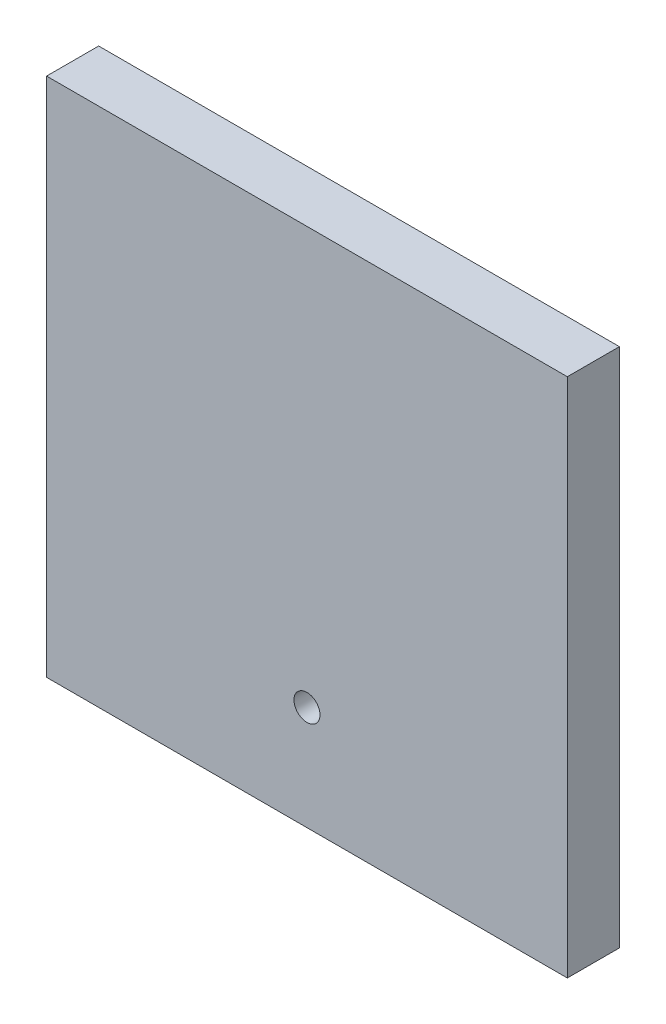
from build123d import *

# Parameters (mm, degrees)
SKETCH_1_W          = 100
SKETCH_1_H          = 100
EXTRUDE_1_DEPTH     = 10
SKETCH_3_R          = 2.5
CUT_EXTRUDE_2_DEPTH = 10


with BuildPart() as part:
    # Sketch 1 → Extrude 1 (new body)
    with BuildSketch(Plane.XY):
        with Locations((50, 50)):
            Rectangle(SKETCH_1_W, SKETCH_1_H)
    extrude(amount=EXTRUDE_1_DEPTH)

    # Sketch 3 → Cut-Extrude 2 (cut)
    with BuildSketch(Plane.XY.offset(10)):
        with Locations((50, 20)):
            Circle(SKETCH_3_R)
    extrude(amount=-CUT_EXTRUDE_2_DEPTH, mode=Mode.SUBTRACT)


solid = part.part
